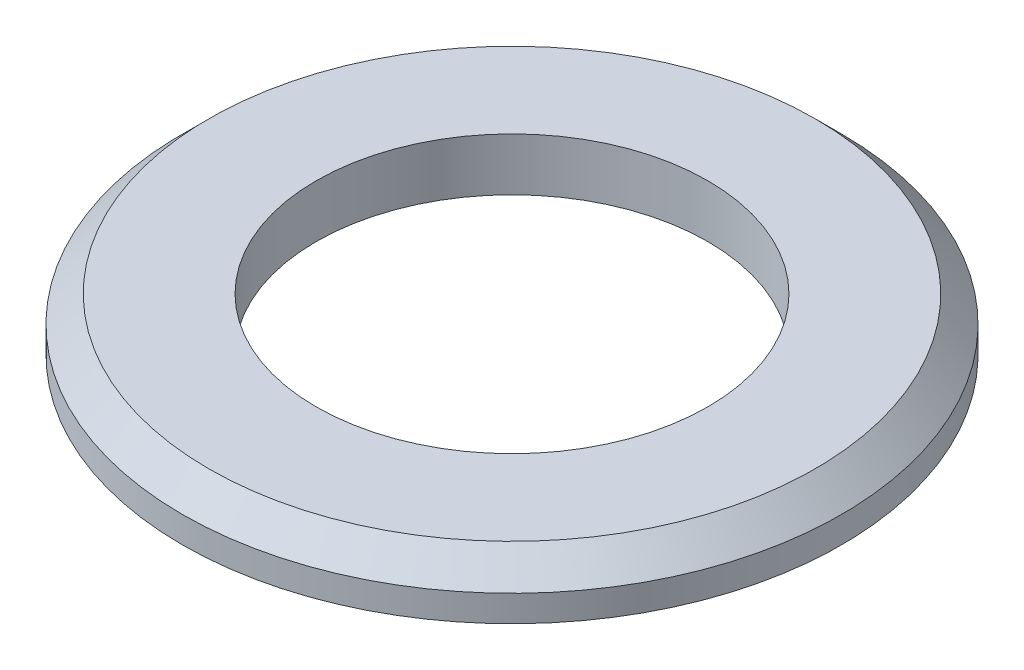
ISO-10303-21;
HEADER;
FILE_DESCRIPTION(('STEP AP214'),'2;1');
FILE_NAME('part.step','',(''),(''),'','','');
FILE_SCHEMA(('AUTOMOTIVE_DESIGN { 1 0 10303 214 1 1 1 1 }'));
ENDSEC;
DATA;
#1=APPLICATION_CONTEXT('core data for automotive mechanical design processes');
#2=APPLICATION_PROTOCOL_DEFINITION('international standard','automotive_design',2000,#1);
#3=PRODUCT_CONTEXT('',#1,'mechanical');
#4=PRODUCT('Part','Part','',(#3));
#5=PRODUCT_RELATED_PRODUCT_CATEGORY('part','',(#4));
#6=PRODUCT_DEFINITION_FORMATION('','',#4);
#7=PRODUCT_DEFINITION_CONTEXT('part definition',#1,'design');
#8=PRODUCT_DEFINITION('design','',#6,#7);
#9=PRODUCT_DEFINITION_SHAPE('','',#8);
#10=(LENGTH_UNIT() NAMED_UNIT(*) SI_UNIT(.MILLI.,.METRE.));
#11=(NAMED_UNIT(*) PLANE_ANGLE_UNIT() SI_UNIT($,.RADIAN.));
#12=(NAMED_UNIT(*) SI_UNIT($,.STERADIAN.) SOLID_ANGLE_UNIT());
#13=UNCERTAINTY_MEASURE_WITH_UNIT(LENGTH_MEASURE(1.E-05),#10,'distance_accuracy_value','');
#14=(GEOMETRIC_REPRESENTATION_CONTEXT(3) GLOBAL_UNCERTAINTY_ASSIGNED_CONTEXT((#13)) GLOBAL_UNIT_ASSIGNED_CONTEXT((#10,
#11,#12)) REPRESENTATION_CONTEXT('',''));
#15=CARTESIAN_POINT('',(0.,0.,0.));
#16=DIRECTION('',(0.,0.,1.));
#17=DIRECTION('',(1.,0.,0.));
#18=AXIS2_PLACEMENT_3D('',#15,#16,#17);
#19=CARTESIAN_POINT('',(0.,14.,0.));
#20=DIRECTION('',(0.,1.,0.));
#21=DIRECTION('',(0.,0.,1.));
#22=AXIS2_PLACEMENT_3D('',#19,#20,#21);
#23=PLANE('',#22);
#24=CARTESIAN_POINT('',(0.,14.,0.));
#25=DIRECTION('',(0.,1.,0.));
#26=DIRECTION('',(0.,0.,1.));
#27=AXIS2_PLACEMENT_3D('',#24,#25,#26);
#28=CIRCLE('',#27,80.5);
#29=CARTESIAN_POINT('',(0.,14.,-80.5));
#30=VERTEX_POINT('',#29);
#31=EDGE_CURVE('E35',#30,#30,#28,.T.);
#32=ORIENTED_EDGE('',*,*,#31,.T.);
#33=EDGE_LOOP('',(#32));
#34=FACE_BOUND('',#33,.T.);
#35=CARTESIAN_POINT('',(0.,14.,0.));
#36=DIRECTION('',(0.,1.,0.));
#37=DIRECTION('',(0.,0.,1.));
#38=AXIS2_PLACEMENT_3D('',#35,#36,#37);
#39=CIRCLE('',#38,52.);
#40=CARTESIAN_POINT('',(0.,14.,52.));
#41=VERTEX_POINT('',#40);
#42=EDGE_CURVE('E43',#41,#41,#39,.T.);
#43=ORIENTED_EDGE('',*,*,#42,.F.);
#44=EDGE_LOOP('',(#43));
#45=FACE_BOUND('',#44,.T.);
#46=ADVANCED_FACE('F28',(#34,#45),#23,.T.);
#47=CARTESIAN_POINT('',(0.,0.,0.));
#48=DIRECTION('',(0.,1.,0.));
#49=DIRECTION('',(0.,0.,1.));
#50=AXIS2_PLACEMENT_3D('',#47,#48,#49);
#51=PLANE('',#50);
#52=CARTESIAN_POINT('',(0.,0.,0.));
#53=DIRECTION('',(0.,1.,0.));
#54=DIRECTION('',(0.,0.,1.));
#55=AXIS2_PLACEMENT_3D('',#52,#53,#54);
#56=CIRCLE('',#55,87.5);
#57=CARTESIAN_POINT('',(0.,0.,87.5));
#58=VERTEX_POINT('',#57);
#59=EDGE_CURVE('E39',#58,#58,#56,.T.);
#60=ORIENTED_EDGE('',*,*,#59,.F.);
#61=EDGE_LOOP('',(#60));
#62=FACE_BOUND('',#61,.T.);
#63=CARTESIAN_POINT('',(0.,0.,0.));
#64=DIRECTION('',(0.,1.,0.));
#65=DIRECTION('',(0.,0.,1.));
#66=AXIS2_PLACEMENT_3D('',#63,#64,#65);
#67=CIRCLE('',#66,52.);
#68=CARTESIAN_POINT('',(0.,0.,52.));
#69=VERTEX_POINT('',#68);
#70=EDGE_CURVE('E48',#69,#69,#67,.T.);
#71=ORIENTED_EDGE('',*,*,#70,.T.);
#72=EDGE_LOOP('',(#71));
#73=FACE_BOUND('',#72,.T.);
#74=ADVANCED_FACE('F52',(#62,#73),#51,.F.);
#75=CARTESIAN_POINT('',(0.,14.,0.));
#76=DIRECTION('',(0.,-1.,0.));
#77=DIRECTION('',(0.,0.,-1.));
#78=AXIS2_PLACEMENT_3D('',#75,#76,#77);
#79=CYLINDRICAL_SURFACE('',#78,87.5);
#80=CARTESIAN_POINT('',(0.,6.99999999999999,0.));
#81=DIRECTION('',(0.,1.,0.));
#82=DIRECTION('',(0.,0.,1.));
#83=AXIS2_PLACEMENT_3D('',#80,#81,#82);
#84=CIRCLE('',#83,87.5);
#85=CARTESIAN_POINT('',(0.,6.99999999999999,-87.5));
#86=VERTEX_POINT('',#85);
#87=EDGE_CURVE('E10',#86,#86,#84,.F.);
#88=ORIENTED_EDGE('',*,*,#87,.T.);
#89=EDGE_LOOP('',(#88));
#90=FACE_BOUND('',#89,.T.);
#91=ORIENTED_EDGE('',*,*,#59,.T.);
#92=EDGE_LOOP('',(#91));
#93=FACE_BOUND('',#92,.T.);
#94=ADVANCED_FACE('F30',(#90,#93),#79,.T.);
#95=CARTESIAN_POINT('',(0.,14.,0.));
#96=DIRECTION('',(0.,-1.,0.));
#97=DIRECTION('',(0.,0.,-1.));
#98=AXIS2_PLACEMENT_3D('',#95,#96,#97);
#99=CYLINDRICAL_SURFACE('',#98,52.);
#100=ORIENTED_EDGE('',*,*,#42,.T.);
#101=EDGE_LOOP('',(#100));
#102=FACE_BOUND('',#101,.T.);
#103=ORIENTED_EDGE('',*,*,#70,.F.);
#104=EDGE_LOOP('',(#103));
#105=FACE_BOUND('',#104,.T.);
#106=ADVANCED_FACE('F54',(#102,#105),#99,.F.);
#107=CARTESIAN_POINT('',(0.,14.,0.));
#108=DIRECTION('',(0.,-1.,0.));
#109=DIRECTION('',(0.,0.,-1.));
#110=AXIS2_PLACEMENT_3D('',#107,#108,#109);
#111=CONICAL_SURFACE('',#110,80.5,0.785398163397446);
#112=CARTESIAN_POINT('',(0.,6.99999999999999,-87.5));
#113=CARTESIAN_POINT('',(0.,7.07291666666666,-87.4270833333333));
#114=CARTESIAN_POINT('',(0.,7.14583333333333,-87.3541666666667));
#115=CARTESIAN_POINT('',(0.,7.29166666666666,-87.2083333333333));
#116=CARTESIAN_POINT('',(0.,7.36458333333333,-87.1354166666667));
#117=CARTESIAN_POINT('',(0.,7.51041666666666,-86.9895833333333));
#118=CARTESIAN_POINT('',(0.,7.58333333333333,-86.9166666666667));
#119=CARTESIAN_POINT('',(0.,7.72916666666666,-86.7708333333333));
#120=CARTESIAN_POINT('',(0.,7.80208333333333,-86.6979166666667));
#121=CARTESIAN_POINT('',(0.,7.94791666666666,-86.5520833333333));
#122=CARTESIAN_POINT('',(0.,8.02083333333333,-86.4791666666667));
#123=CARTESIAN_POINT('',(0.,8.16666666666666,-86.3333333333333));
#124=CARTESIAN_POINT('',(0.,8.23958333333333,-86.2604166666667));
#125=CARTESIAN_POINT('',(0.,8.38541666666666,-86.1145833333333));
#126=CARTESIAN_POINT('',(0.,8.45833333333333,-86.0416666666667));
#127=CARTESIAN_POINT('',(0.,8.60416666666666,-85.8958333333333));
#128=CARTESIAN_POINT('',(0.,8.67708333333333,-85.8229166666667));
#129=CARTESIAN_POINT('',(0.,8.82291666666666,-85.6770833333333));
#130=CARTESIAN_POINT('',(0.,8.89583333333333,-85.6041666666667));
#131=CARTESIAN_POINT('',(0.,9.04166666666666,-85.4583333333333));
#132=CARTESIAN_POINT('',(0.,9.11458333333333,-85.3854166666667));
#133=CARTESIAN_POINT('',(0.,9.26041666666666,-85.2395833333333));
#134=CARTESIAN_POINT('',(0.,9.33333333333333,-85.1666666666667));
#135=CARTESIAN_POINT('',(0.,9.47916666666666,-85.0208333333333));
#136=CARTESIAN_POINT('',(0.,9.55208333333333,-84.9479166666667));
#137=CARTESIAN_POINT('',(0.,9.69791666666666,-84.8020833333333));
#138=CARTESIAN_POINT('',(0.,9.77083333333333,-84.7291666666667));
#139=CARTESIAN_POINT('',(0.,9.91666666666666,-84.5833333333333));
#140=CARTESIAN_POINT('',(0.,9.98958333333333,-84.5104166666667));
#141=CARTESIAN_POINT('',(0.,10.1354166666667,-84.3645833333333));
#142=CARTESIAN_POINT('',(0.,10.2083333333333,-84.2916666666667));
#143=CARTESIAN_POINT('',(0.,10.3541666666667,-84.1458333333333));
#144=CARTESIAN_POINT('',(0.,10.4270833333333,-84.0729166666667));
#145=CARTESIAN_POINT('',(0.,10.5729166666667,-83.9270833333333));
#146=CARTESIAN_POINT('',(0.,10.6458333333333,-83.8541666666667));
#147=CARTESIAN_POINT('',(0.,10.7916666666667,-83.7083333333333));
#148=CARTESIAN_POINT('',(0.,10.8645833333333,-83.6354166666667));
#149=CARTESIAN_POINT('',(0.,11.0104166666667,-83.4895833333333));
#150=CARTESIAN_POINT('',(0.,11.0833333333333,-83.4166666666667));
#151=CARTESIAN_POINT('',(0.,11.2291666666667,-83.2708333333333));
#152=CARTESIAN_POINT('',(0.,11.3020833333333,-83.1979166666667));
#153=CARTESIAN_POINT('',(0.,11.4479166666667,-83.0520833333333));
#154=CARTESIAN_POINT('',(0.,11.5208333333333,-82.9791666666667));
#155=CARTESIAN_POINT('',(0.,11.6666666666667,-82.8333333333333));
#156=CARTESIAN_POINT('',(0.,11.7395833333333,-82.7604166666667));
#157=CARTESIAN_POINT('',(0.,11.8854166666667,-82.6145833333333));
#158=CARTESIAN_POINT('',(0.,11.9583333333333,-82.5416666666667));
#159=CARTESIAN_POINT('',(0.,12.1041666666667,-82.3958333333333));
#160=CARTESIAN_POINT('',(0.,12.1770833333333,-82.3229166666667));
#161=CARTESIAN_POINT('',(0.,12.3229166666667,-82.1770833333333));
#162=CARTESIAN_POINT('',(0.,12.3958333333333,-82.1041666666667));
#163=CARTESIAN_POINT('',(0.,12.5416666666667,-81.9583333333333));
#164=CARTESIAN_POINT('',(0.,12.6145833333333,-81.8854166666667));
#165=CARTESIAN_POINT('',(0.,12.7604166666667,-81.7395833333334));
#166=CARTESIAN_POINT('',(0.,12.8333333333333,-81.6666666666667));
#167=CARTESIAN_POINT('',(0.,12.9791666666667,-81.5208333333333));
#168=CARTESIAN_POINT('',(0.,13.0520833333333,-81.4479166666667));
#169=CARTESIAN_POINT('',(0.,13.1979166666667,-81.3020833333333));
#170=CARTESIAN_POINT('',(0.,13.2708333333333,-81.2291666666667));
#171=CARTESIAN_POINT('',(0.,13.4166666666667,-81.0833333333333));
#172=CARTESIAN_POINT('',(0.,13.4895833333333,-81.0104166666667));
#173=CARTESIAN_POINT('',(0.,13.6354166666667,-80.8645833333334));
#174=CARTESIAN_POINT('',(0.,13.7083333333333,-80.7916666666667));
#175=CARTESIAN_POINT('',(0.,13.8541666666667,-80.6458333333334));
#176=CARTESIAN_POINT('',(0.,13.9270833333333,-80.5729166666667));
#177=CARTESIAN_POINT('',(0.,14.,-80.5));
#178=B_SPLINE_CURVE_WITH_KNOTS('',3,(#112,#113,#114,#115,#116,#117,#118,#119,#120,#121,#122,
#123,#124,#125,#126,#127,#128,#129,#130,#131,#132,#133,#134,#135,#136,#137,#138,#139,#140,#141,
#142,#143,#144,#145,#146,#147,#148,#149,#150,#151,#152,#153,#154,#155,#156,#157,#158,#159,#160,
#161,#162,#163,#164,#165,#166,#167,#168,#169,#170,#171,#172,#173,#174,#175,#176,#177),
.UNSPECIFIED.,.F.,.F.,(4,2,2,2,2,2,2,2,2,2,2,2,2,2,2,2,2,2,2,2,2,2,2,2,2,2,2,2,2,2,2,2,4),(0.,
0.309359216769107,0.618718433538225,0.928077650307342,1.23743686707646,1.54679608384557,
1.85615530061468,2.1655145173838,2.47487373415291,2.78423295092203,3.09359216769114,
3.40295138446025,3.71231060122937,4.02166981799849,4.3310290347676,4.64038825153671,
4.94974746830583,5.25910668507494,5.56846590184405,5.87782511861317,6.18718433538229,
6.49654355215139,6.80590276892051,7.11526198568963,7.42462120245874,7.73398041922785,
8.04333963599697,8.35269885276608,8.66205806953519,8.97141728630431,9.28077650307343,
9.59013571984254,9.89949493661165),.UNSPECIFIED.);
#179=EDGE_CURVE('BSEAM56',#86,#30,#178,.T.);
#180=ORIENTED_EDGE('',*,*,#87,.F.);
#181=ORIENTED_EDGE('',*,*,#31,.F.);
#182=ORIENTED_EDGE('',*,*,#179,.T.);
#183=ORIENTED_EDGE('',*,*,#179,.F.);
#184=EDGE_LOOP('',(#180,#182,#181,#183));
#185=FACE_BOUND('',#184,.T.);
#186=ADVANCED_FACE('F56',(#185),#111,.T.);
#187=CLOSED_SHELL('',(#46,#74,#94,#106,#186));
#188=MANIFOLD_SOLID_BREP('B2',#187);
#189=ADVANCED_BREP_SHAPE_REPRESENTATION('',(#18,#188),#14);
#190=SHAPE_DEFINITION_REPRESENTATION(#9,#189);
ENDSEC;
END-ISO-10303-21;
